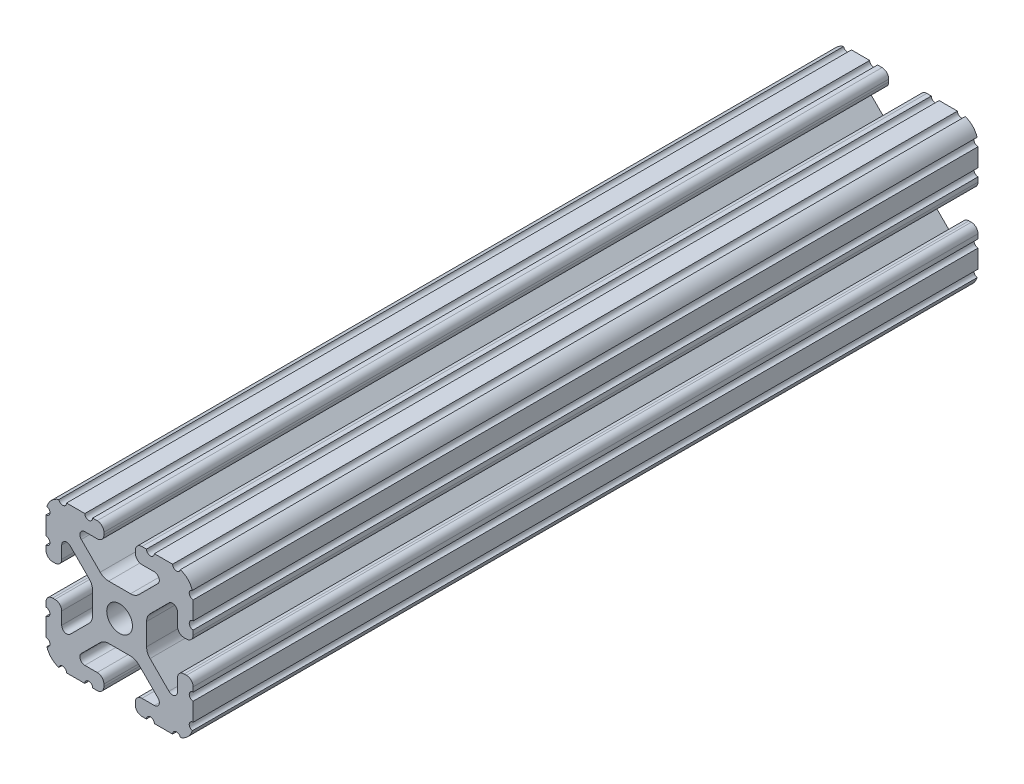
from build123d import *

# Parameters (mm, degrees)
BOSS_EXTRUDE1_DEPTH     = 457.2
CUT_EXTRUDE1_DEPTH      = 458.993062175
CUT_EXTRUDE1_DEPTH_BACK = 458.993062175
SKETCH5_R               = 1.016
SKETCH6_W               = 39.134581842
SKETCH6_H               = 38.977379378
CUT_EXTRUDE2_DEPTH      = 711.2


with BuildPart() as part:
    # Sketch4 → Boss-Extrude1 (new, symmetric)
    with BuildSketch(Plane.XY):
        with BuildLine():
            Line((5.7912, -19.05), (14.3002, -19.05))
            ThreePointArc((14.3002, -19.05), (17.658815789, -17.658815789), (19.05, -14.3002))
            Line((19.05, -14.3002), (19.05, -5.7912))
            ThreePointArc((19.05, -5.7912), (18.544114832, -4.569885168), (17.3228, -4.064))
            Line((17.3228, -4.064), (16.7132, -4.064))
            ThreePointArc((16.7132, -4.064), (15.491885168, -4.569885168), (14.986, -5.7912))
            Line((14.986, -5.7912), (14.986, -8.996305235))
            ThreePointArc((14.986, -8.996305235), (14.189232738, -10.188751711), (12.782646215, -9.908964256))
            Line((12.782646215, -9.908964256), (7.888897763, -5.015215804))
            ThreePointArc((7.888897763, -5.015215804), (7.219915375, -4.014012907), (6.985, -2.833013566))
            Line((6.985, -2.833013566), (6.985, 0))
            Line((6.985, 0), (3.3274, 0))
            ThreePointArc((3.3274, 0), (2.352827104, -2.352827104), (0, -3.3274))
            Line((0, -3.3274), (0, -6.985))
            Line((0, -6.985), (2.833013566, -6.985))
            ThreePointArc((2.833013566, -6.985), (4.014012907, -7.219915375), (5.015215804, -7.888897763))
            Line((5.015215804, -7.888897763), (9.908964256, -12.782646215))
            ThreePointArc((9.908964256, -12.782646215), (10.188751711, -14.189232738), (8.996305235, -14.986))
            Line((8.996305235, -14.986), (5.7912, -14.986))
            ThreePointArc((5.7912, -14.986), (4.569885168, -15.491885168), (4.064, -16.7132))
            Line((4.064, -16.7132), (4.064, -17.3228))
            ThreePointArc((4.064, -17.3228), (4.569885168, -18.544114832), (5.7912, -19.05))
        make_face()
    extrude(amount=BOSS_EXTRUDE1_DEPTH, both=True)

    # Sketch5 → Cut-Extrude1 (cut, two sides: drawn at the far end of the back side and taken through both)
    with BuildSketch(Plane.XY.offset(-CUT_EXTRUDE1_DEPTH_BACK)):
        with Locations((14.739477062, -19.05)):
            Circle(SKETCH5_R)
        with Locations((7.980305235, -19.05)):
            Circle(SKETCH5_R)
        with Locations((19.05, -14.739477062)):
            Circle(SKETCH5_R)
        with Locations((19.05, -7.980305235)):
            Circle(SKETCH5_R)
    extrude(amount=CUT_EXTRUDE1_DEPTH + CUT_EXTRUDE1_DEPTH_BACK, mode=Mode.SUBTRACT)

    # Mirror1: part across plane


with BuildPart() as part_1:
    add(part.part)
    add(part.part.mirror(Plane(origin=(0, 0, 0), x_dir=(0, 0, 1), z_dir=(1, 0, 0))))

    # Mirror2: part across plane


with BuildPart() as part_2:
    add(part_1.part)
    add(part_1.part.mirror(Plane.ZX))

    # Sketch6 → Cut-Extrude2 (cut)
    with BuildSketch(Plane.XY.offset(457.2)):
        Rectangle(SKETCH6_W, SKETCH6_H)
    extrude(amount=-CUT_EXTRUDE2_DEPTH, mode=Mode.SUBTRACT)


solid = part_2.part
